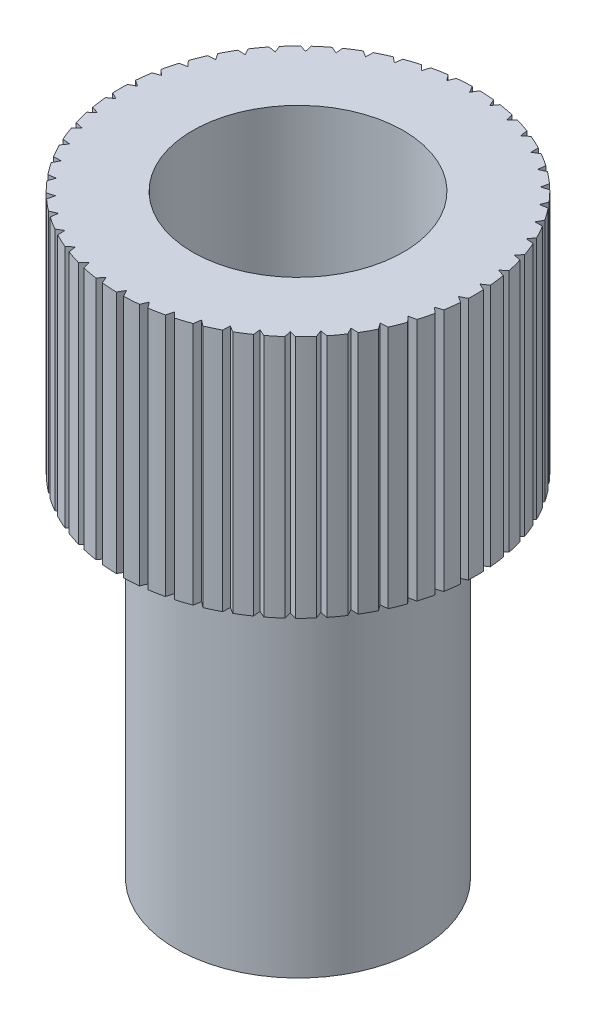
from build123d import *

# Parameters (mm, degrees)
CUT_EXTRUDE1_DEPTH = 17.823785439
CIRPATTERN1_COUNT  = 50


with BuildPart() as part:
    # Sketch1 → Revolve1 (revolve)
    with BuildSketch(Plane.XY, mode=Mode.PRIVATE) as revolve1_sk:
        Polygon((1.651, 0), (1.651, 10.652497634), (2.7432, 10.652497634), (2.7432, 15.494), (4.6355, 15.494), (4.6355, 9.144), (3.175, 9.144), (3.175, 0), align=None)
    revolve(revolve1_sk.sketch.rotate(Axis((0, 0, 0), (0, 1, 0)), 90), axis=Axis((0, 0, 0), (0, 1, 0)))

    # Sketch2 → Cut-Extrude1 (cut, through all)
    with BuildSketch(Plane(origin=(0, 15.494, 0), x_dir=(-1, 0, 0), z_dir=(0, 1, 0))):
        Polygon((0, 4.467370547), (-0.258622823, 4.915318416), (0.258622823, 4.915318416), align=None)
    cut_extrude1 = extrude(amount=-CUT_EXTRUDE1_DEPTH, mode=Mode.SUBTRACT)

    # CirPattern1: Cut-Extrude1 ×50 about axis
    cirpattern1_axis = Axis((0, 0, 0), (0, 1, 0))
    for i in range(1, CIRPATTERN1_COUNT):
        add(cut_extrude1.rotate(cirpattern1_axis, i * 360 / CIRPATTERN1_COUNT), mode=Mode.SUBTRACT)


solid = part.part
